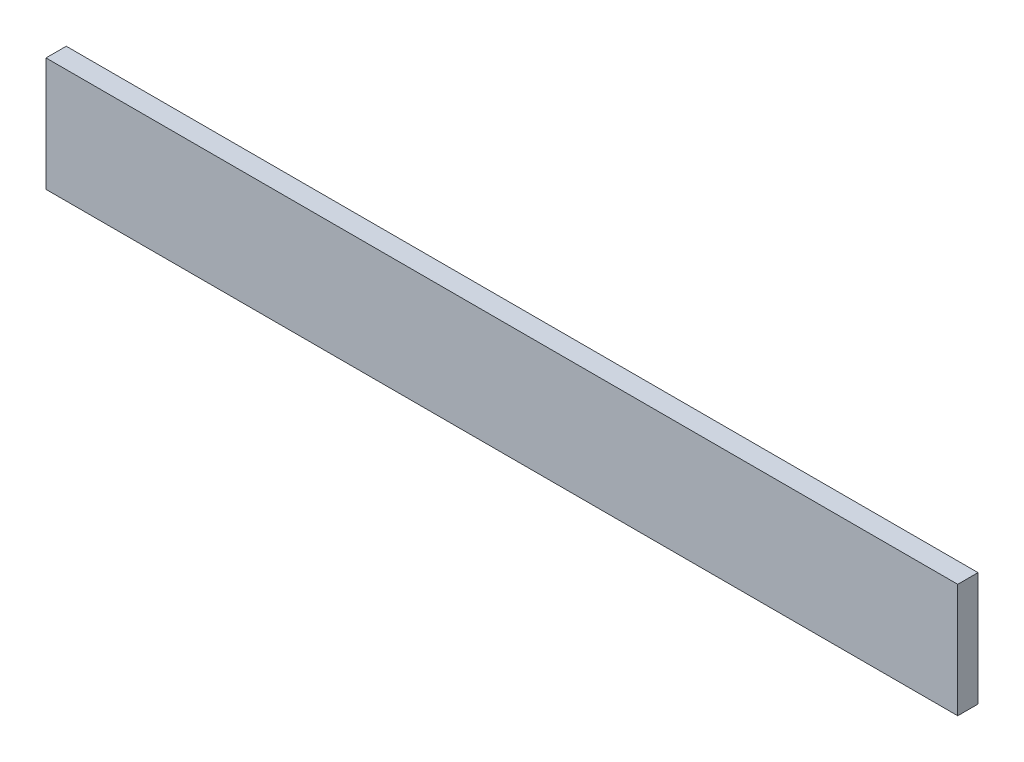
from build123d import *

# Parameters (mm, degrees)
SKETCH1_W           = 571.5
SKETCH1_H           = 71.374
BOSS_EXTRUDE1_DEPTH = 12.7


with BuildPart() as part:
    # Sketch1 → Boss-Extrude1 (new body)
    with BuildSketch(Plane.XY):
        Rectangle(SKETCH1_W, SKETCH1_H)
    extrude(amount=BOSS_EXTRUDE1_DEPTH)


solid = part.part
